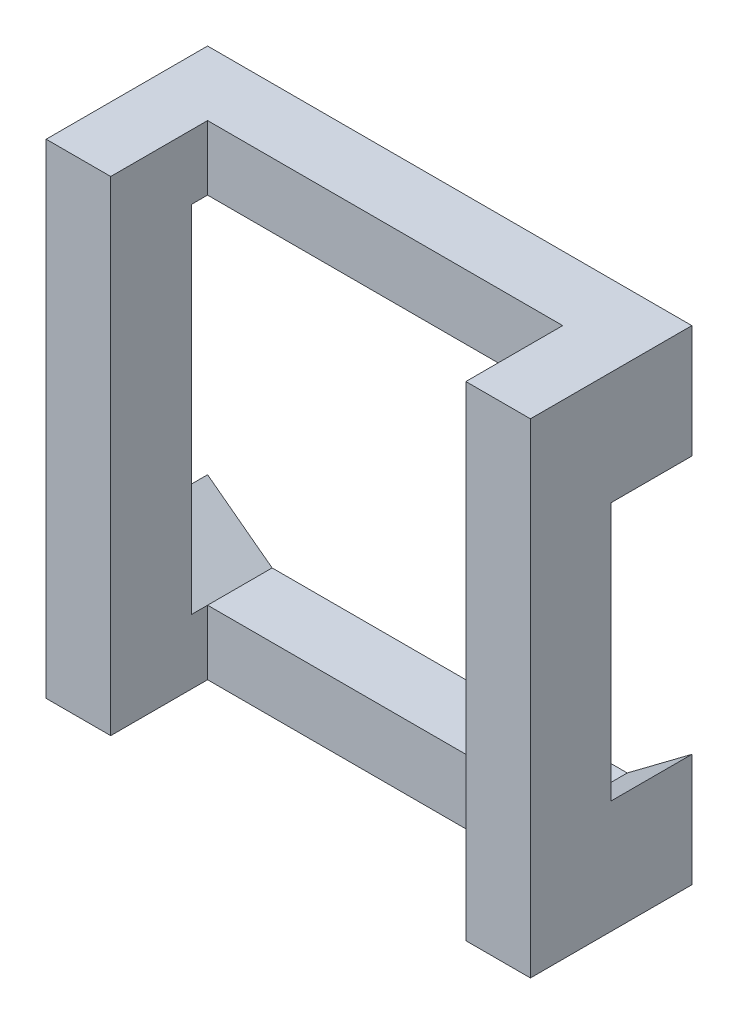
ISO-10303-21;
HEADER;
FILE_DESCRIPTION(('STEP AP214'),'2;1');
FILE_NAME('part.step','',(''),(''),'','','');
FILE_SCHEMA(('AUTOMOTIVE_DESIGN { 1 0 10303 214 1 1 1 1 }'));
ENDSEC;
DATA;
#1=APPLICATION_CONTEXT('core data for automotive mechanical design processes');
#2=APPLICATION_PROTOCOL_DEFINITION('international standard','automotive_design',2000,#1);
#3=PRODUCT_CONTEXT('',#1,'mechanical');
#4=PRODUCT('Part','Part','',(#3));
#5=PRODUCT_RELATED_PRODUCT_CATEGORY('part','',(#4));
#6=PRODUCT_DEFINITION_FORMATION('','',#4);
#7=PRODUCT_DEFINITION_CONTEXT('part definition',#1,'design');
#8=PRODUCT_DEFINITION('design','',#6,#7);
#9=PRODUCT_DEFINITION_SHAPE('','',#8);
#10=(LENGTH_UNIT() NAMED_UNIT(*) SI_UNIT(.MILLI.,.METRE.));
#11=(NAMED_UNIT(*) PLANE_ANGLE_UNIT() SI_UNIT($,.RADIAN.));
#12=(NAMED_UNIT(*) SI_UNIT($,.STERADIAN.) SOLID_ANGLE_UNIT());
#13=UNCERTAINTY_MEASURE_WITH_UNIT(LENGTH_MEASURE(1.E-05),#10,'distance_accuracy_value','');
#14=(GEOMETRIC_REPRESENTATION_CONTEXT(3) GLOBAL_UNCERTAINTY_ASSIGNED_CONTEXT((#13)) GLOBAL_UNIT_ASSIGNED_CONTEXT((#10,
#11,#12)) REPRESENTATION_CONTEXT('',''));
#15=CARTESIAN_POINT('',(0.,0.,0.));
#16=DIRECTION('',(0.,0.,1.));
#17=DIRECTION('',(1.,0.,0.));
#18=AXIS2_PLACEMENT_3D('',#15,#16,#17);
#19=CARTESIAN_POINT('',(0.,0.,2.));
#20=DIRECTION('',(0.,0.,-1.));
#21=DIRECTION('',(-1.,0.,0.));
#22=AXIS2_PLACEMENT_3D('',#19,#20,#21);
#23=PLANE('',#22);
#24=DIRECTION('',(-1.,0.,0.));
#25=VECTOR('',#24,1.);
#26=CARTESIAN_POINT('',(0.,6.,2.));
#27=LINE('',#26,#25);
#28=CARTESIAN_POINT('',(6.,6.,2.));
#29=VERTEX_POINT('',#28);
#30=CARTESIAN_POINT('',(5.2,6.,2.));
#31=VERTEX_POINT('',#30);
#32=EDGE_CURVE('E187',#29,#31,#27,.T.);
#33=ORIENTED_EDGE('',*,*,#32,.T.);
#34=DIRECTION('',(0.,-1.,0.));
#35=VECTOR('',#34,1.);
#36=CARTESIAN_POINT('',(5.2,0.8,2.));
#37=LINE('',#36,#35);
#38=CARTESIAN_POINT('',(5.2,0.,2.));
#39=VERTEX_POINT('',#38);
#40=EDGE_CURVE('E171',#31,#39,#37,.T.);
#41=ORIENTED_EDGE('',*,*,#40,.T.);
#42=DIRECTION('',(1.,0.,0.));
#43=VECTOR('',#42,1.);
#44=CARTESIAN_POINT('',(0.,0.,2.));
#45=LINE('',#44,#43);
#46=CARTESIAN_POINT('',(6.,0.,2.));
#47=VERTEX_POINT('',#46);
#48=EDGE_CURVE('E239',#39,#47,#45,.T.);
#49=ORIENTED_EDGE('',*,*,#48,.T.);
#50=DIRECTION('',(0.,1.,0.));
#51=VECTOR('',#50,1.);
#52=CARTESIAN_POINT('',(6.,0.,2.));
#53=LINE('',#52,#51);
#54=EDGE_CURVE('E195',#47,#29,#53,.T.);
#55=ORIENTED_EDGE('',*,*,#54,.T.);
#56=EDGE_LOOP('',(#33,#41,#49,#55));
#57=FACE_BOUND('',#56,.T.);
#58=ADVANCED_FACE('F34',(#57),#23,.F.);
#59=CARTESIAN_POINT('',(0.,0.,1.));
#60=DIRECTION('',(0.,0.,1.));
#61=DIRECTION('',(1.,0.,0.));
#62=AXIS2_PLACEMENT_3D('',#59,#60,#61);
#63=PLANE('',#62);
#64=DIRECTION('',(0.8,0.6,0.));
#65=VECTOR('',#64,1.);
#66=CARTESIAN_POINT('',(0.8,5.2,1.));
#67=LINE('',#66,#65);
#68=CARTESIAN_POINT('',(0.,4.6,1.));
#69=VERTEX_POINT('',#68);
#70=CARTESIAN_POINT('',(0.8,5.2,1.));
#71=VERTEX_POINT('',#70);
#72=EDGE_CURVE('E246',#69,#71,#67,.T.);
#73=ORIENTED_EDGE('',*,*,#72,.T.);
#74=DIRECTION('',(0.,1.,0.));
#75=VECTOR('',#74,1.);
#76=CARTESIAN_POINT('',(0.8,0.8,1.));
#77=LINE('',#76,#75);
#78=CARTESIAN_POINT('',(0.8,0.8,1.));
#79=VERTEX_POINT('',#78);
#80=EDGE_CURVE('E296',#79,#71,#77,.T.);
#81=ORIENTED_EDGE('',*,*,#80,.F.);
#82=DIRECTION('',(-0.8,0.6,0.));
#83=VECTOR('',#82,1.);
#84=CARTESIAN_POINT('',(0.8,0.8,1.));
#85=LINE('',#84,#83);
#86=CARTESIAN_POINT('',(0.,1.4,1.));
#87=VERTEX_POINT('',#86);
#88=EDGE_CURVE('E283',#79,#87,#85,.T.);
#89=ORIENTED_EDGE('',*,*,#88,.T.);
#90=DIRECTION('',(0.,1.,0.));
#91=VECTOR('',#90,1.);
#92=CARTESIAN_POINT('',(0.,4.6,1.));
#93=LINE('',#92,#91);
#94=EDGE_CURVE('E280',#87,#69,#93,.T.);
#95=ORIENTED_EDGE('',*,*,#94,.T.);
#96=EDGE_LOOP('',(#73,#81,#89,#95));
#97=FACE_BOUND('',#96,.T.);
#98=ADVANCED_FACE('F344',(#97),#63,.F.);
#99=CARTESIAN_POINT('',(0.,0.,0.));
#100=DIRECTION('',(0.,0.,-1.));
#101=DIRECTION('',(-1.,0.,0.));
#102=AXIS2_PLACEMENT_3D('',#99,#100,#101);
#103=PLANE('',#102);
#104=DIRECTION('',(0.8,-0.6,0.));
#105=VECTOR('',#104,1.);
#106=CARTESIAN_POINT('',(5.2,5.2,0.));
#107=LINE('',#106,#105);
#108=CARTESIAN_POINT('',(5.2,5.2,0.));
#109=VERTEX_POINT('',#108);
#110=CARTESIAN_POINT('',(6.,4.6,0.));
#111=VERTEX_POINT('',#110);
#112=EDGE_CURVE('E182',#109,#111,#107,.T.);
#113=ORIENTED_EDGE('',*,*,#112,.F.);
#114=DIRECTION('',(1.,0.,0.));
#115=VECTOR('',#114,1.);
#116=CARTESIAN_POINT('',(5.2,5.2,0.));
#117=LINE('',#116,#115);
#118=CARTESIAN_POINT('',(0.8,5.2,0.));
#119=VERTEX_POINT('',#118);
#120=EDGE_CURVE('E264',#119,#109,#117,.T.);
#121=ORIENTED_EDGE('',*,*,#120,.F.);
#122=DIRECTION('',(0.8,0.6,0.));
#123=VECTOR('',#122,1.);
#124=CARTESIAN_POINT('',(0.8,5.2,0.));
#125=LINE('',#124,#123);
#126=CARTESIAN_POINT('',(0.,4.6,0.));
#127=VERTEX_POINT('',#126);
#128=EDGE_CURVE('E268',#127,#119,#125,.T.);
#129=ORIENTED_EDGE('',*,*,#128,.F.);
#130=DIRECTION('',(0.,-1.,0.));
#131=VECTOR('',#130,1.);
#132=CARTESIAN_POINT('',(0.,0.,0.));
#133=LINE('',#132,#131);
#134=CARTESIAN_POINT('',(0.,6.,0.));
#135=VERTEX_POINT('',#134);
#136=EDGE_CURVE('E204',#135,#127,#133,.T.);
#137=ORIENTED_EDGE('',*,*,#136,.F.);
#138=DIRECTION('',(-1.,0.,0.));
#139=VECTOR('',#138,1.);
#140=CARTESIAN_POINT('',(0.,6.,0.));
#141=LINE('',#140,#139);
#142=CARTESIAN_POINT('',(6.,6.,0.));
#143=VERTEX_POINT('',#142);
#144=EDGE_CURVE('E80',#143,#135,#141,.T.);
#145=ORIENTED_EDGE('',*,*,#144,.F.);
#146=DIRECTION('',(0.,1.,0.));
#147=VECTOR('',#146,1.);
#148=CARTESIAN_POINT('',(6.,0.,0.));
#149=LINE('',#148,#147);
#150=EDGE_CURVE('E210',#111,#143,#149,.T.);
#151=ORIENTED_EDGE('',*,*,#150,.F.);
#152=EDGE_LOOP('',(#113,#121,#129,#137,#145,#151));
#153=FACE_BOUND('',#152,.T.);
#154=ADVANCED_FACE('F336',(#153),#103,.T.);
#155=CARTESIAN_POINT('',(0.,0.,2.));
#156=DIRECTION('',(1.,0.,0.));
#157=DIRECTION('',(0.,0.,-1.));
#158=AXIS2_PLACEMENT_3D('',#155,#156,#157);
#159=PLANE('',#158);
#160=ORIENTED_EDGE('',*,*,#136,.T.);
#161=DIRECTION('',(0.,0.,-1.));
#162=VECTOR('',#161,1.);
#163=CARTESIAN_POINT('',(0.,4.6,1.));
#164=LINE('',#163,#162);
#165=EDGE_CURVE('E256',#69,#127,#164,.T.);
#166=ORIENTED_EDGE('',*,*,#165,.F.);
#167=ORIENTED_EDGE('',*,*,#94,.F.);
#168=DIRECTION('',(0.,0.,-1.));
#169=VECTOR('',#168,1.);
#170=CARTESIAN_POINT('',(0.,1.4,1.));
#171=LINE('',#170,#169);
#172=CARTESIAN_POINT('',(0.,1.4,0.));
#173=VERTEX_POINT('',#172);
#174=EDGE_CURVE('E228',#87,#173,#171,.T.);
#175=ORIENTED_EDGE('',*,*,#174,.T.);
#176=CARTESIAN_POINT('',(0.,0.,0.));
#177=VERTEX_POINT('',#176);
#178=EDGE_CURVE('E208',#173,#177,#133,.T.);
#179=ORIENTED_EDGE('',*,*,#178,.T.);
#180=DIRECTION('',(0.,0.,-1.));
#181=VECTOR('',#180,1.);
#182=CARTESIAN_POINT('',(0.,0.,2.));
#183=LINE('',#182,#181);
#184=CARTESIAN_POINT('',(0.,0.,2.));
#185=VERTEX_POINT('',#184);
#186=EDGE_CURVE('E42',#185,#177,#183,.T.);
#187=ORIENTED_EDGE('',*,*,#186,.F.);
#188=DIRECTION('',(0.,-1.,0.));
#189=VECTOR('',#188,1.);
#190=CARTESIAN_POINT('',(0.,0.,2.));
#191=LINE('',#190,#189);
#192=CARTESIAN_POINT('',(0.,6.,2.));
#193=VERTEX_POINT('',#192);
#194=EDGE_CURVE('E214',#193,#185,#191,.T.);
#195=ORIENTED_EDGE('',*,*,#194,.F.);
#196=DIRECTION('',(0.,0.,-1.));
#197=VECTOR('',#196,1.);
#198=CARTESIAN_POINT('',(0.,6.,2.));
#199=LINE('',#198,#197);
#200=EDGE_CURVE('E197',#193,#135,#199,.T.);
#201=ORIENTED_EDGE('',*,*,#200,.T.);
#202=EDGE_LOOP('',(#160,#166,#167,#175,#179,#187,#195,#201));
#203=FACE_BOUND('',#202,.T.);
#204=ADVANCED_FACE('F36',(#203),#159,.F.);
#205=CARTESIAN_POINT('',(0.,0.,2.));
#206=DIRECTION('',(0.,1.,0.));
#207=DIRECTION('',(0.,0.,1.));
#208=AXIS2_PLACEMENT_3D('',#205,#206,#207);
#209=PLANE('',#208);
#210=ORIENTED_EDGE('',*,*,#48,.F.);
#211=DIRECTION('',(0.,0.,1.));
#212=VECTOR('',#211,1.);
#213=CARTESIAN_POINT('',(5.2,0.,2.));
#214=LINE('',#213,#212);
#215=CARTESIAN_POINT('',(5.2,0.,0.8));
#216=VERTEX_POINT('',#215);
#217=EDGE_CURVE('E178',#216,#39,#214,.T.);
#218=ORIENTED_EDGE('',*,*,#217,.F.);
#219=DIRECTION('',(1.,0.,0.));
#220=VECTOR('',#219,1.);
#221=CARTESIAN_POINT('',(5.2,0.,0.8));
#222=LINE('',#221,#220);
#223=CARTESIAN_POINT('',(0.8,0.,0.8));
#224=VERTEX_POINT('',#223);
#225=EDGE_CURVE('E192',#224,#216,#222,.T.);
#226=ORIENTED_EDGE('',*,*,#225,.F.);
#227=DIRECTION('',(0.,0.,-1.));
#228=VECTOR('',#227,1.);
#229=CARTESIAN_POINT('',(0.8,0.,2.));
#230=LINE('',#229,#228);
#231=CARTESIAN_POINT('',(0.8,0.,2.));
#232=VERTEX_POINT('',#231);
#233=EDGE_CURVE('E311',#232,#224,#230,.T.);
#234=ORIENTED_EDGE('',*,*,#233,.F.);
#235=EDGE_CURVE('E88',#185,#232,#45,.T.);
#236=ORIENTED_EDGE('',*,*,#235,.F.);
#237=ORIENTED_EDGE('',*,*,#186,.T.);
#238=DIRECTION('',(1.,0.,0.));
#239=VECTOR('',#238,1.);
#240=CARTESIAN_POINT('',(0.,0.,0.));
#241=LINE('',#240,#239);
#242=CARTESIAN_POINT('',(6.,0.,0.));
#243=VERTEX_POINT('',#242);
#244=EDGE_CURVE('E207',#177,#243,#241,.T.);
#245=ORIENTED_EDGE('',*,*,#244,.T.);
#246=DIRECTION('',(0.,0.,-1.));
#247=VECTOR('',#246,1.);
#248=CARTESIAN_POINT('',(6.,0.,2.));
#249=LINE('',#248,#247);
#250=EDGE_CURVE('E217',#47,#243,#249,.T.);
#251=ORIENTED_EDGE('',*,*,#250,.F.);
#252=EDGE_LOOP('',(#210,#218,#226,#234,#236,#237,#245,#251));
#253=FACE_BOUND('',#252,.T.);
#254=ADVANCED_FACE('F220',(#253),#209,.F.);
#255=CARTESIAN_POINT('',(6.,0.,2.));
#256=DIRECTION('',(-1.,0.,0.));
#257=DIRECTION('',(0.,0.,1.));
#258=AXIS2_PLACEMENT_3D('',#255,#256,#257);
#259=PLANE('',#258);
#260=DIRECTION('',(0.,-1.,0.));
#261=VECTOR('',#260,1.);
#262=CARTESIAN_POINT('',(6.,4.6,1.));
#263=LINE('',#262,#261);
#264=CARTESIAN_POINT('',(6.,4.6,1.));
#265=VERTEX_POINT('',#264);
#266=CARTESIAN_POINT('',(6.,1.4,1.));
#267=VERTEX_POINT('',#266);
#268=EDGE_CURVE('E289',#265,#267,#263,.T.);
#269=ORIENTED_EDGE('',*,*,#268,.F.);
#270=DIRECTION('',(0.,0.,-1.));
#271=VECTOR('',#270,1.);
#272=CARTESIAN_POINT('',(6.,4.6,1.));
#273=LINE('',#272,#271);
#274=EDGE_CURVE('E243',#265,#111,#273,.T.);
#275=ORIENTED_EDGE('',*,*,#274,.T.);
#276=ORIENTED_EDGE('',*,*,#150,.T.);
#277=DIRECTION('',(0.,0.,-1.));
#278=VECTOR('',#277,1.);
#279=CARTESIAN_POINT('',(6.,6.,2.));
#280=LINE('',#279,#278);
#281=EDGE_CURVE('E199',#29,#143,#280,.T.);
#282=ORIENTED_EDGE('',*,*,#281,.F.);
#283=ORIENTED_EDGE('',*,*,#54,.F.);
#284=ORIENTED_EDGE('',*,*,#250,.T.);
#285=CARTESIAN_POINT('',(6.,1.4,0.));
#286=VERTEX_POINT('',#285);
#287=EDGE_CURVE('E211',#243,#286,#149,.T.);
#288=ORIENTED_EDGE('',*,*,#287,.T.);
#289=DIRECTION('',(0.,0.,-1.));
#290=VECTOR('',#289,1.);
#291=CARTESIAN_POINT('',(6.,1.4,1.));
#292=LINE('',#291,#290);
#293=EDGE_CURVE('E49',#267,#286,#292,.T.);
#294=ORIENTED_EDGE('',*,*,#293,.F.);
#295=EDGE_LOOP('',(#269,#275,#276,#282,#283,#284,#288,#294));
#296=FACE_BOUND('',#295,.T.);
#297=ADVANCED_FACE('F238',(#296),#259,.F.);
#298=CARTESIAN_POINT('',(0.,6.,2.));
#299=DIRECTION('',(0.,-1.,0.));
#300=DIRECTION('',(0.,0.,-1.));
#301=AXIS2_PLACEMENT_3D('',#298,#299,#300);
#302=PLANE('',#301);
#303=DIRECTION('',(1.,0.,0.));
#304=VECTOR('',#303,1.);
#305=CARTESIAN_POINT('',(5.2,6.,0.8));
#306=LINE('',#305,#304);
#307=CARTESIAN_POINT('',(0.8,6.,0.8));
#308=VERTEX_POINT('',#307);
#309=CARTESIAN_POINT('',(5.2,6.,0.8));
#310=VERTEX_POINT('',#309);
#311=EDGE_CURVE('E190',#308,#310,#306,.T.);
#312=ORIENTED_EDGE('',*,*,#311,.T.);
#313=DIRECTION('',(0.,0.,1.));
#314=VECTOR('',#313,1.);
#315=CARTESIAN_POINT('',(5.2,6.,2.));
#316=LINE('',#315,#314);
#317=EDGE_CURVE('E175',#310,#31,#316,.T.);
#318=ORIENTED_EDGE('',*,*,#317,.T.);
#319=ORIENTED_EDGE('',*,*,#32,.F.);
#320=ORIENTED_EDGE('',*,*,#281,.T.);
#321=ORIENTED_EDGE('',*,*,#144,.T.);
#322=ORIENTED_EDGE('',*,*,#200,.F.);
#323=CARTESIAN_POINT('',(0.8,6.,2.));
#324=VERTEX_POINT('',#323);
#325=EDGE_CURVE('E58',#324,#193,#27,.T.);
#326=ORIENTED_EDGE('',*,*,#325,.F.);
#327=DIRECTION('',(0.,0.,-1.));
#328=VECTOR('',#327,1.);
#329=CARTESIAN_POINT('',(0.8,6.,2.));
#330=LINE('',#329,#328);
#331=EDGE_CURVE('E191',#324,#308,#330,.T.);
#332=ORIENTED_EDGE('',*,*,#331,.T.);
#333=EDGE_LOOP('',(#312,#318,#319,#320,#321,#322,#326,#332));
#334=FACE_BOUND('',#333,.T.);
#335=ADVANCED_FACE('F186',(#334),#302,.F.);
#336=ORIENTED_EDGE('',*,*,#235,.T.);
#337=DIRECTION('',(0.,1.,0.));
#338=VECTOR('',#337,1.);
#339=CARTESIAN_POINT('',(0.8,0.8,2.));
#340=LINE('',#339,#338);
#341=EDGE_CURVE('E183',#232,#324,#340,.T.);
#342=ORIENTED_EDGE('',*,*,#341,.T.);
#343=ORIENTED_EDGE('',*,*,#325,.T.);
#344=ORIENTED_EDGE('',*,*,#194,.T.);
#345=EDGE_LOOP('',(#336,#342,#343,#344));
#346=FACE_BOUND('',#345,.T.);
#347=ADVANCED_FACE('F365',(#346),#23,.F.);
#348=DIRECTION('',(-0.8,0.6,0.));
#349=VECTOR('',#348,1.);
#350=CARTESIAN_POINT('',(0.8,0.8,0.));
#351=LINE('',#350,#349);
#352=CARTESIAN_POINT('',(0.8,0.8,0.));
#353=VERTEX_POINT('',#352);
#354=EDGE_CURVE('E271',#353,#173,#351,.T.);
#355=ORIENTED_EDGE('',*,*,#354,.F.);
#356=DIRECTION('',(-1.,0.,0.));
#357=VECTOR('',#356,1.);
#358=CARTESIAN_POINT('',(5.2,0.8,0.));
#359=LINE('',#358,#357);
#360=CARTESIAN_POINT('',(5.2,0.8,0.));
#361=VERTEX_POINT('',#360);
#362=EDGE_CURVE('E273',#361,#353,#359,.T.);
#363=ORIENTED_EDGE('',*,*,#362,.F.);
#364=DIRECTION('',(-0.8,-0.6,0.));
#365=VECTOR('',#364,1.);
#366=CARTESIAN_POINT('',(5.2,0.8,0.));
#367=LINE('',#366,#365);
#368=EDGE_CURVE('E235',#286,#361,#367,.T.);
#369=ORIENTED_EDGE('',*,*,#368,.F.);
#370=ORIENTED_EDGE('',*,*,#287,.F.);
#371=ORIENTED_EDGE('',*,*,#244,.F.);
#372=ORIENTED_EDGE('',*,*,#178,.F.);
#373=EDGE_LOOP('',(#355,#363,#369,#370,#371,#372));
#374=FACE_BOUND('',#373,.T.);
#375=ADVANCED_FACE('F233',(#374),#103,.T.);
#376=CARTESIAN_POINT('',(5.2,5.2,1.));
#377=DIRECTION('',(0.6,0.8,0.));
#378=DIRECTION('',(-0.8,0.6,0.));
#379=AXIS2_PLACEMENT_3D('',#376,#377,#378);
#380=PLANE('',#379);
#381=ORIENTED_EDGE('',*,*,#112,.T.);
#382=ORIENTED_EDGE('',*,*,#274,.F.);
#383=DIRECTION('',(0.8,-0.6,0.));
#384=VECTOR('',#383,1.);
#385=CARTESIAN_POINT('',(5.2,5.2,1.));
#386=LINE('',#385,#384);
#387=CARTESIAN_POINT('',(5.2,5.2,1.));
#388=VERTEX_POINT('',#387);
#389=EDGE_CURVE('E267',#388,#265,#386,.T.);
#390=ORIENTED_EDGE('',*,*,#389,.F.);
#391=DIRECTION('',(0.,0.,-1.));
#392=VECTOR('',#391,1.);
#393=CARTESIAN_POINT('',(5.2,5.2,1.));
#394=LINE('',#393,#392);
#395=CARTESIAN_POINT('',(5.2,5.2,0.8));
#396=VERTEX_POINT('',#395);
#397=EDGE_CURVE('E231',#388,#396,#394,.T.);
#398=ORIENTED_EDGE('',*,*,#397,.T.);
#399=EDGE_CURVE('E261',#396,#109,#394,.T.);
#400=ORIENTED_EDGE('',*,*,#399,.T.);
#401=EDGE_LOOP('',(#381,#382,#390,#398,#400));
#402=FACE_BOUND('',#401,.T.);
#403=ADVANCED_FACE('F331',(#402),#380,.F.);
#404=CARTESIAN_POINT('',(5.2,5.2,1.));
#405=DIRECTION('',(0.,1.,0.));
#406=DIRECTION('',(0.,0.,1.));
#407=AXIS2_PLACEMENT_3D('',#404,#405,#406);
#408=PLANE('',#407);
#409=ORIENTED_EDGE('',*,*,#399,.F.);
#410=DIRECTION('',(-1.,0.,0.));
#411=VECTOR('',#410,1.);
#412=CARTESIAN_POINT('',(5.2,5.2,0.8));
#413=LINE('',#412,#411);
#414=CARTESIAN_POINT('',(0.8,5.2,0.8));
#415=VERTEX_POINT('',#414);
#416=EDGE_CURVE('E297',#396,#415,#413,.T.);
#417=ORIENTED_EDGE('',*,*,#416,.T.);
#418=DIRECTION('',(0.,0.,-1.));
#419=VECTOR('',#418,1.);
#420=CARTESIAN_POINT('',(0.8,5.2,1.));
#421=LINE('',#420,#419);
#422=EDGE_CURVE('E258',#415,#119,#421,.T.);
#423=ORIENTED_EDGE('',*,*,#422,.T.);
#424=ORIENTED_EDGE('',*,*,#120,.T.);
#425=EDGE_LOOP('',(#409,#417,#423,#424));
#426=FACE_BOUND('',#425,.T.);
#427=ADVANCED_FACE('F325',(#426),#408,.F.);
#428=CARTESIAN_POINT('',(0.8,5.2,1.));
#429=DIRECTION('',(-0.6,0.8,0.));
#430=DIRECTION('',(-0.8,-0.6,0.));
#431=AXIS2_PLACEMENT_3D('',#428,#429,#430);
#432=PLANE('',#431);
#433=ORIENTED_EDGE('',*,*,#128,.T.);
#434=ORIENTED_EDGE('',*,*,#422,.F.);
#435=EDGE_CURVE('E259',#71,#415,#421,.T.);
#436=ORIENTED_EDGE('',*,*,#435,.F.);
#437=ORIENTED_EDGE('',*,*,#72,.F.);
#438=ORIENTED_EDGE('',*,*,#165,.T.);
#439=EDGE_LOOP('',(#433,#434,#436,#437,#438));
#440=FACE_BOUND('',#439,.T.);
#441=ADVANCED_FACE('F341',(#440),#432,.F.);
#442=CARTESIAN_POINT('',(0.8,0.8,1.));
#443=DIRECTION('',(-0.6,-0.8,0.));
#444=DIRECTION('',(0.8,-0.6,0.));
#445=AXIS2_PLACEMENT_3D('',#442,#443,#444);
#446=PLANE('',#445);
#447=ORIENTED_EDGE('',*,*,#354,.T.);
#448=ORIENTED_EDGE('',*,*,#174,.F.);
#449=ORIENTED_EDGE('',*,*,#88,.F.);
#450=DIRECTION('',(0.,0.,-1.));
#451=VECTOR('',#450,1.);
#452=CARTESIAN_POINT('',(0.8,0.8,1.));
#453=LINE('',#452,#451);
#454=CARTESIAN_POINT('',(0.8,0.8,0.8));
#455=VERTEX_POINT('',#454);
#456=EDGE_CURVE('E252',#79,#455,#453,.T.);
#457=ORIENTED_EDGE('',*,*,#456,.T.);
#458=EDGE_CURVE('E251',#455,#353,#453,.T.);
#459=ORIENTED_EDGE('',*,*,#458,.T.);
#460=EDGE_LOOP('',(#447,#448,#449,#457,#459));
#461=FACE_BOUND('',#460,.T.);
#462=ADVANCED_FACE('F347',(#461),#446,.F.);
#463=CARTESIAN_POINT('',(5.2,0.8,1.));
#464=DIRECTION('',(0.,-1.,0.));
#465=DIRECTION('',(0.,0.,-1.));
#466=AXIS2_PLACEMENT_3D('',#463,#464,#465);
#467=PLANE('',#466);
#468=ORIENTED_EDGE('',*,*,#458,.F.);
#469=DIRECTION('',(1.,0.,0.));
#470=VECTOR('',#469,1.);
#471=CARTESIAN_POINT('',(5.2,0.8,0.8));
#472=LINE('',#471,#470);
#473=CARTESIAN_POINT('',(5.2,0.8,0.8));
#474=VERTEX_POINT('',#473);
#475=EDGE_CURVE('E11',#455,#474,#472,.T.);
#476=ORIENTED_EDGE('',*,*,#475,.T.);
#477=DIRECTION('',(0.,0.,-1.));
#478=VECTOR('',#477,1.);
#479=CARTESIAN_POINT('',(5.2,0.8,1.));
#480=LINE('',#479,#478);
#481=EDGE_CURVE('E248',#474,#361,#480,.T.);
#482=ORIENTED_EDGE('',*,*,#481,.T.);
#483=ORIENTED_EDGE('',*,*,#362,.T.);
#484=EDGE_LOOP('',(#468,#476,#482,#483));
#485=FACE_BOUND('',#484,.T.);
#486=ADVANCED_FACE('F350',(#485),#467,.F.);
#487=CARTESIAN_POINT('',(5.2,0.8,1.));
#488=DIRECTION('',(0.6,-0.8,0.));
#489=DIRECTION('',(0.8,0.6,0.));
#490=AXIS2_PLACEMENT_3D('',#487,#488,#489);
#491=PLANE('',#490);
#492=ORIENTED_EDGE('',*,*,#368,.T.);
#493=ORIENTED_EDGE('',*,*,#481,.F.);
#494=CARTESIAN_POINT('',(5.2,0.8,1.));
#495=VERTEX_POINT('',#494);
#496=EDGE_CURVE('E249',#495,#474,#480,.T.);
#497=ORIENTED_EDGE('',*,*,#496,.F.);
#498=DIRECTION('',(-0.8,-0.6,0.));
#499=VECTOR('',#498,1.);
#500=CARTESIAN_POINT('',(5.2,0.8,1.));
#501=LINE('',#500,#499);
#502=EDGE_CURVE('E286',#267,#495,#501,.T.);
#503=ORIENTED_EDGE('',*,*,#502,.F.);
#504=ORIENTED_EDGE('',*,*,#293,.T.);
#505=EDGE_LOOP('',(#492,#493,#497,#503,#504));
#506=FACE_BOUND('',#505,.T.);
#507=ADVANCED_FACE('F353',(#506),#491,.F.);
#508=ORIENTED_EDGE('',*,*,#502,.T.);
#509=DIRECTION('',(0.,-1.,0.));
#510=VECTOR('',#509,1.);
#511=CARTESIAN_POINT('',(5.2,0.8,1.));
#512=LINE('',#511,#510);
#513=EDGE_CURVE('E294',#388,#495,#512,.T.);
#514=ORIENTED_EDGE('',*,*,#513,.F.);
#515=ORIENTED_EDGE('',*,*,#389,.T.);
#516=ORIENTED_EDGE('',*,*,#268,.T.);
#517=EDGE_LOOP('',(#508,#514,#515,#516));
#518=FACE_BOUND('',#517,.T.);
#519=ADVANCED_FACE('F333',(#518),#63,.F.);
#520=CARTESIAN_POINT('',(0.8,0.8,2.));
#521=DIRECTION('',(-1.,0.,0.));
#522=DIRECTION('',(0.,0.,1.));
#523=AXIS2_PLACEMENT_3D('',#520,#521,#522);
#524=PLANE('',#523);
#525=ORIENTED_EDGE('',*,*,#80,.T.);
#526=ORIENTED_EDGE('',*,*,#435,.T.);
#527=DIRECTION('',(0.,-1.,0.));
#528=VECTOR('',#527,1.);
#529=CARTESIAN_POINT('',(0.8,6.,0.8));
#530=LINE('',#529,#528);
#531=EDGE_CURVE('E303',#308,#415,#530,.T.);
#532=ORIENTED_EDGE('',*,*,#531,.F.);
#533=ORIENTED_EDGE('',*,*,#331,.F.);
#534=ORIENTED_EDGE('',*,*,#341,.F.);
#535=ORIENTED_EDGE('',*,*,#233,.T.);
#536=EDGE_CURVE('E307',#455,#224,#530,.T.);
#537=ORIENTED_EDGE('',*,*,#536,.F.);
#538=ORIENTED_EDGE('',*,*,#456,.F.);
#539=EDGE_LOOP('',(#525,#526,#532,#533,#534,#535,#537,#538));
#540=FACE_BOUND('',#539,.T.);
#541=ADVANCED_FACE('F318',(#540),#524,.F.);
#542=CARTESIAN_POINT('',(5.2,0.8,2.));
#543=DIRECTION('',(1.,0.,0.));
#544=DIRECTION('',(0.,0.,-1.));
#545=AXIS2_PLACEMENT_3D('',#542,#543,#544);
#546=PLANE('',#545);
#547=ORIENTED_EDGE('',*,*,#513,.T.);
#548=ORIENTED_EDGE('',*,*,#496,.T.);
#549=DIRECTION('',(0.,-1.,0.));
#550=VECTOR('',#549,1.);
#551=CARTESIAN_POINT('',(5.2,6.,0.8));
#552=LINE('',#551,#550);
#553=EDGE_CURVE('E306',#474,#216,#552,.T.);
#554=ORIENTED_EDGE('',*,*,#553,.T.);
#555=ORIENTED_EDGE('',*,*,#217,.T.);
#556=ORIENTED_EDGE('',*,*,#40,.F.);
#557=ORIENTED_EDGE('',*,*,#317,.F.);
#558=EDGE_CURVE('E302',#310,#396,#552,.T.);
#559=ORIENTED_EDGE('',*,*,#558,.T.);
#560=ORIENTED_EDGE('',*,*,#397,.F.);
#561=EDGE_LOOP('',(#547,#548,#554,#555,#556,#557,#559,#560));
#562=FACE_BOUND('',#561,.T.);
#563=ADVANCED_FACE('F173',(#562),#546,.F.);
#564=CARTESIAN_POINT('',(5.2,6.,0.8));
#565=DIRECTION('',(0.,0.,-1.));
#566=DIRECTION('',(-1.,0.,0.));
#567=AXIS2_PLACEMENT_3D('',#564,#565,#566);
#568=PLANE('',#567);
#569=ORIENTED_EDGE('',*,*,#536,.T.);
#570=ORIENTED_EDGE('',*,*,#225,.T.);
#571=ORIENTED_EDGE('',*,*,#553,.F.);
#572=ORIENTED_EDGE('',*,*,#475,.F.);
#573=EDGE_LOOP('',(#569,#570,#571,#572));
#574=FACE_BOUND('',#573,.T.);
#575=ADVANCED_FACE('F478',(#574),#568,.F.);
#576=ORIENTED_EDGE('',*,*,#558,.F.);
#577=ORIENTED_EDGE('',*,*,#311,.F.);
#578=ORIENTED_EDGE('',*,*,#531,.T.);
#579=ORIENTED_EDGE('',*,*,#416,.F.);
#580=EDGE_LOOP('',(#576,#577,#578,#579));
#581=FACE_BOUND('',#580,.T.);
#582=ADVANCED_FACE('F321',(#581),#568,.F.);
#583=CLOSED_SHELL('',(#58,#98,#154,#204,#254,#297,#335,#347,#375,#403,#427,#441,#462,#486,#507,
#519,#541,#563,#575,#582));
#584=MANIFOLD_SOLID_BREP('B2',#583);
#585=ADVANCED_BREP_SHAPE_REPRESENTATION('',(#18,#584),#14);
#586=SHAPE_DEFINITION_REPRESENTATION(#9,#585);
ENDSEC;
END-ISO-10303-21;
